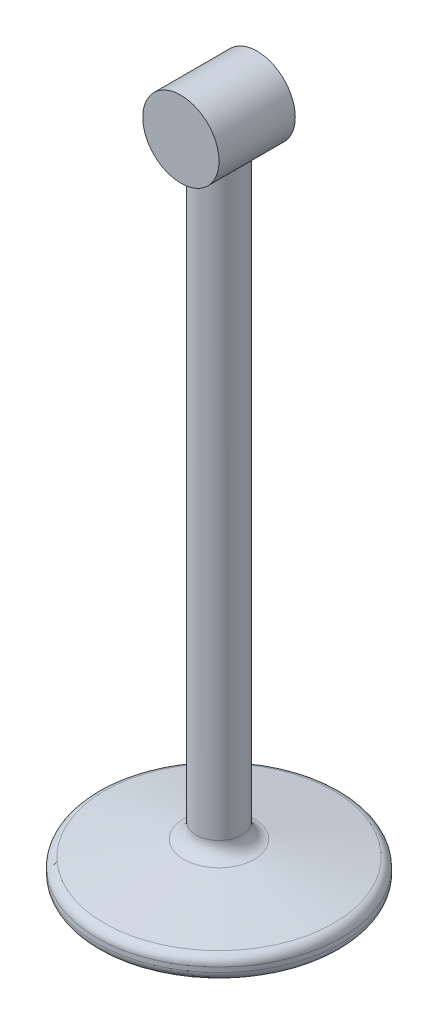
from build123d import *

# Parameters (mm, degrees)
SKETCH1_R           = 1.905
EXTRUDE1_DEPTH      = 50.8
EXTRUDE2_DEPTH      = 3.175
EXTRUDE2_DEPTH_BACK = 3.175
SKETCH3_R           = 3.175


with BuildPart() as part:
    # Sketch1 → Extrude1 (new body)
    with BuildSketch(Plane(origin=(0, 0, 0), x_dir=(1, 0, 0), z_dir=(0, 1, 0))):
        with Locations(Location((0, 0, 0), (0, 0, 270))):
            Circle(SKETCH1_R)
    extrude(amount=EXTRUDE1_DEPTH)

    # Sketch3 → Extrude2 (add, two sides: drawn at the far end of the back side and taken through both)
    with BuildSketch(Plane.XY.offset(-EXTRUDE2_DEPTH_BACK)):
        with Locations((0, 50.8)):
            Circle(SKETCH3_R)
    extrude(amount=EXTRUDE2_DEPTH + EXTRUDE2_DEPTH_BACK)

    # S2D0008 → Revolve1 (revolve)
    with BuildSketch(Plane.XY, mode=Mode.PRIVATE) as revolve1_sk:
        with BuildLine():
            Line((0, -4.445), (0, 0))
            Line((0, 0), (1.905, 0))
            ThreePointArc((1.905, 0), (2.194556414, -0.807236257), (2.931189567, -1.24637734))
            Line((2.931189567, -1.24637734), (9.54428626, -2.54))
            ThreePointArc((9.54428626, -2.54), (9.986266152, -2.803484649), (10.16, -3.287826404))
            Line((10.16, -3.287826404), (10.16, -3.683))
            ThreePointArc((10.16, -3.683), (9.936815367, -4.221815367), (9.398, -4.445))
            Line((9.398, -4.445), (0, -4.445))
        make_face()
    revolve(revolve1_sk.sketch.rotate(Axis((0, -4.445, 0), (0, 1, 0)), 90), axis=Axis((0, -4.445, 0), (0, 1, 0)))


solid = part.part
